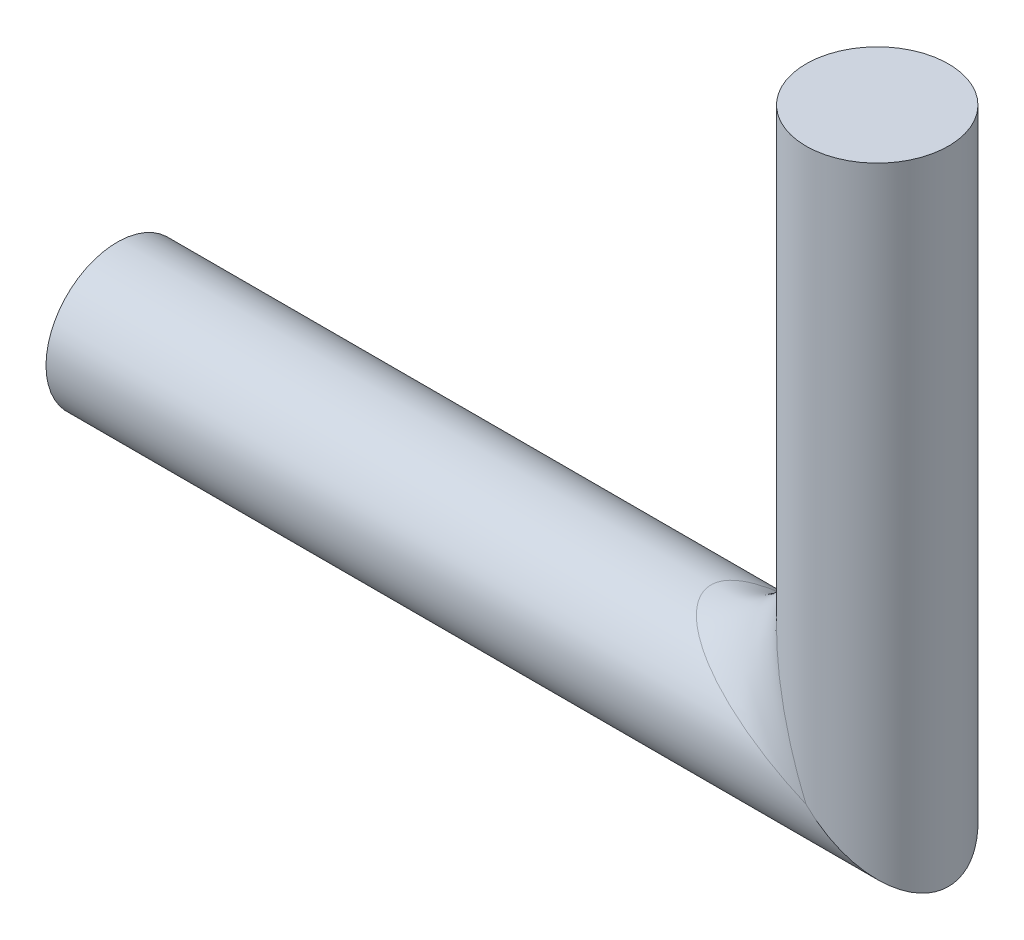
ISO-10303-21;
HEADER;
FILE_DESCRIPTION(('STEP AP214'),'2;1');
FILE_NAME('part.step','',(''),(''),'','','');
FILE_SCHEMA(('AUTOMOTIVE_DESIGN { 1 0 10303 214 1 1 1 1 }'));
ENDSEC;
DATA;
#1=APPLICATION_CONTEXT('core data for automotive mechanical design processes');
#2=APPLICATION_PROTOCOL_DEFINITION('international standard','automotive_design',2000,#1);
#3=PRODUCT_CONTEXT('',#1,'mechanical');
#4=PRODUCT('Part','Part','',(#3));
#5=PRODUCT_RELATED_PRODUCT_CATEGORY('part','',(#4));
#6=PRODUCT_DEFINITION_FORMATION('','',#4);
#7=PRODUCT_DEFINITION_CONTEXT('part definition',#1,'design');
#8=PRODUCT_DEFINITION('design','',#6,#7);
#9=PRODUCT_DEFINITION_SHAPE('','',#8);
#10=(LENGTH_UNIT() NAMED_UNIT(*) SI_UNIT(.MILLI.,.METRE.));
#11=(NAMED_UNIT(*) PLANE_ANGLE_UNIT() SI_UNIT($,.RADIAN.));
#12=(NAMED_UNIT(*) SI_UNIT($,.STERADIAN.) SOLID_ANGLE_UNIT());
#13=UNCERTAINTY_MEASURE_WITH_UNIT(LENGTH_MEASURE(1.E-05),#10,'distance_accuracy_value','');
#14=(GEOMETRIC_REPRESENTATION_CONTEXT(3) GLOBAL_UNCERTAINTY_ASSIGNED_CONTEXT((#13)) GLOBAL_UNIT_ASSIGNED_CONTEXT((#10,
#11,#12)) REPRESENTATION_CONTEXT('',''));
#15=CARTESIAN_POINT('',(0.,0.,0.));
#16=DIRECTION('',(0.,0.,1.));
#17=DIRECTION('',(1.,0.,0.));
#18=AXIS2_PLACEMENT_3D('',#15,#16,#17);
#19=CARTESIAN_POINT('',(18.,0.,0.));
#20=DIRECTION('',(-1.,0.,0.));
#21=DIRECTION('',(0.,0.,1.));
#22=AXIS2_PLACEMENT_3D('',#19,#20,#21);
#23=CYLINDRICAL_SURFACE('',#22,1.5);
#24=CARTESIAN_POINT('',(18.,0.,0.));
#25=DIRECTION('',(0.393919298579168,0.919145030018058,0.));
#26=DIRECTION('',(-0.919145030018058,0.393919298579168,0.));
#27=AXIS2_PLACEMENT_3D('',#24,#25,#26);
#28=ELLIPSE('',#27,3.80788655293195,1.5);
#29=CARTESIAN_POINT('',(18.,0.,1.5));
#30=VERTEX_POINT('',#29);
#31=CARTESIAN_POINT('',(18.,0.,-1.5));
#32=VERTEX_POINT('',#31);
#33=EDGE_CURVE('E52',#30,#32,#28,.F.);
#34=ORIENTED_EDGE('',*,*,#33,.T.);
#35=CARTESIAN_POINT('',(18.,0.,0.));
#36=DIRECTION('',(0.707106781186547,0.707106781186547,0.));
#37=DIRECTION('',(-0.707106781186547,0.707106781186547,0.));
#38=AXIS2_PLACEMENT_3D('',#35,#36,#37);
#39=ELLIPSE('',#38,2.12132034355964,1.5);
#40=EDGE_CURVE('E58',#30,#32,#39,.T.);
#41=ORIENTED_EDGE('',*,*,#40,.F.);
#42=EDGE_LOOP('',(#34,#41));
#43=FACE_BOUND('',#42,.T.);
#44=CARTESIAN_POINT('',(2.,0.,0.));
#45=DIRECTION('',(-1.,0.,0.));
#46=DIRECTION('',(0.,0.,1.));
#47=AXIS2_PLACEMENT_3D('',#44,#45,#46);
#48=CIRCLE('',#47,1.5);
#49=CARTESIAN_POINT('',(2.,0.,1.5));
#50=VERTEX_POINT('',#49);
#51=EDGE_CURVE('E47',#50,#50,#48,.T.);
#52=ORIENTED_EDGE('',*,*,#51,.F.);
#53=EDGE_LOOP('',(#52));
#54=FACE_BOUND('',#53,.T.);
#55=ADVANCED_FACE('F39',(#43,#54),#23,.T.);
#56=CARTESIAN_POINT('',(18.,-1.5,0.));
#57=DIRECTION('',(0.,1.,0.));
#58=DIRECTION('',(0.,0.,1.));
#59=AXIS2_PLACEMENT_3D('',#56,#57,#58);
#60=CYLINDRICAL_SURFACE('',#59,1.5);
#61=CARTESIAN_POINT('',(18.,12.,0.));
#62=DIRECTION('',(0.,1.,0.));
#63=DIRECTION('',(0.,0.,1.));
#64=AXIS2_PLACEMENT_3D('',#61,#62,#63);
#65=CIRCLE('',#64,1.5);
#66=CARTESIAN_POINT('',(18.,12.,1.5));
#67=VERTEX_POINT('',#66);
#68=EDGE_CURVE('E65',#67,#67,#65,.T.);
#69=ORIENTED_EDGE('',*,*,#68,.F.);
#70=EDGE_LOOP('',(#69));
#71=FACE_BOUND('',#70,.T.);
#72=CARTESIAN_POINT('',(18.,0.,0.));
#73=DIRECTION('',(0.919145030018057,0.393919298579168,0.));
#74=DIRECTION('',(-0.393919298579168,0.919145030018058,0.));
#75=AXIS2_PLACEMENT_3D('',#72,#73,#74);
#76=ELLIPSE('',#75,3.80788655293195,1.5);
#77=EDGE_CURVE('E11',#32,#30,#76,.T.);
#78=ORIENTED_EDGE('',*,*,#77,.T.);
#79=ORIENTED_EDGE('',*,*,#40,.T.);
#80=EDGE_LOOP('',(#78,#79));
#81=FACE_BOUND('',#80,.T.);
#82=ADVANCED_FACE('F67',(#71,#81),#60,.T.);
#83=CARTESIAN_POINT('',(18.,12.,0.));
#84=DIRECTION('',(0.,1.,0.));
#85=DIRECTION('',(0.,0.,1.));
#86=AXIS2_PLACEMENT_3D('',#83,#84,#85);
#87=PLANE('',#86);
#88=ORIENTED_EDGE('',*,*,#68,.T.);
#89=EDGE_LOOP('',(#88));
#90=FACE_BOUND('',#89,.T.);
#91=ADVANCED_FACE('F77',(#90),#87,.T.);
#92=CARTESIAN_POINT('',(18.,0.,1.5));
#93=CARTESIAN_POINT('',(18.,0.,1.5));
#94=CARTESIAN_POINT('',(18.,0.,1.5));
#95=CARTESIAN_POINT('',(17.8475233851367,0.0653471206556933,1.49997370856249));
#96=CARTESIAN_POINT('',(17.8910658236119,0.108934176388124,1.50023792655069));
#97=CARTESIAN_POINT('',(17.9346528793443,0.152476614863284,1.49997370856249));
#98=CARTESIAN_POINT('',(17.6950078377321,0.130710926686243,1.49572763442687));
#99=CARTESIAN_POINT('',(17.7818328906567,0.218167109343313,1.49002988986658));
#100=CARTESIAN_POINT('',(17.8692890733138,0.304992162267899,1.49572763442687));
#101=CARTESIAN_POINT('',(17.3925995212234,0.260314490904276,1.47867971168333));
#102=CARTESIAN_POINT('',(17.568083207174,0.431916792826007,1.45028833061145));
#103=CARTESIAN_POINT('',(17.7396855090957,0.607400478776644,1.47867971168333));
#104=CARTESIAN_POINT('',(17.2426954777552,0.324559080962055,1.46595089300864));
#105=CARTESIAN_POINT('',(17.4629485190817,0.537051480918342,1.42069733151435));
#106=CARTESIAN_POINT('',(17.6754409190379,0.757304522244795,1.46595089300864));
#107=CARTESIAN_POINT('',(16.9480630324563,0.450830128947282,1.43211276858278));
#108=CARTESIAN_POINT('',(17.261463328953,0.738536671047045,1.34340417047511));
#109=CARTESIAN_POINT('',(17.5491698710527,1.05193696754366,1.43211276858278));
#110=CARTESIAN_POINT('',(16.8032899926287,0.512875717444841,1.41114760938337));
#111=CARTESIAN_POINT('',(17.1645025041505,0.835497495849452,1.29558861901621));
#112=CARTESIAN_POINT('',(17.4871242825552,1.1967100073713,1.41114760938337));
#113=CARTESIAN_POINT('',(16.5214408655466,0.633668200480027,1.36111493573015));
#114=CARTESIAN_POINT('',(16.9833044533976,1.01669554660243,1.18453422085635));
#115=CARTESIAN_POINT('',(17.36633179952,1.4785591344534,1.36111493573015));
#116=CARTESIAN_POINT('',(16.3842630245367,0.692458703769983,1.33225974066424));
#117=CARTESIAN_POINT('',(16.8984764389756,1.10152356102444,1.12112509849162));
#118=CARTESIAN_POINT('',(17.30754129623,1.61573697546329,1.33225974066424));
#119=CARTESIAN_POINT('',(16.1200105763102,0.805709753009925,1.26687391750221));
#120=CARTESIAN_POINT('',(16.7452066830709,1.25479331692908,0.982824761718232));
#121=CARTESIAN_POINT('',(17.1942902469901,1.87998942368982,1.26687391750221));
#122=CARTESIAN_POINT('',(15.992753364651,0.860248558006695,1.23061683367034));
#123=CARTESIAN_POINT('',(16.676208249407,1.32379175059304,0.907711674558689));
#124=CARTESIAN_POINT('',(17.1397514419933,2.00724663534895,1.23061683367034));
#125=CARTESIAN_POINT('',(15.7506057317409,0.964026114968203,1.15098522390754));
#126=CARTESIAN_POINT('',(16.5576602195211,1.44233978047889,0.751598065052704));
#127=CARTESIAN_POINT('',(17.0359738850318,2.24939426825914,1.15098522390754));
#128=CARTESIAN_POINT('',(15.6354291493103,1.01338750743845,1.10793345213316));
#129=CARTESIAN_POINT('',(16.5076073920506,1.49239260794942,0.670336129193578));
#130=CARTESIAN_POINT('',(16.9866124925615,2.36457085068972,1.10793345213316));
#131=CARTESIAN_POINT('',(15.4195225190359,1.10591892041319,1.01540083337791));
#132=CARTESIAN_POINT('',(16.4288328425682,1.57116715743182,0.50933934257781));
#133=CARTESIAN_POINT('',(16.8940810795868,2.5804774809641,1.01540083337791));
#134=CARTESIAN_POINT('',(15.318386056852,1.14926311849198,0.96627201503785));
#135=CARTESIAN_POINT('',(16.3996810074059,1.60031899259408,0.429325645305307));
#136=CARTESIAN_POINT('',(16.850736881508,2.68161394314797,0.966272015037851));
#137=CARTESIAN_POINT('',(15.1324161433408,1.22896450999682,0.862400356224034));
#138=CARTESIAN_POINT('',(16.3624911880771,1.63750881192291,0.279863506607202));
#139=CARTESIAN_POINT('',(16.7710354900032,2.86758385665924,0.862400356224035));
#140=CARTESIAN_POINT('',(15.0470542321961,1.26554818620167,0.808009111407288));
#141=CARTESIAN_POINT('',(16.3541090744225,1.6458909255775,0.210147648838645));
#142=CARTESIAN_POINT('',(16.7344518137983,2.95294576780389,0.808009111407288));
#143=CARTESIAN_POINT('',(14.8942190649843,1.3310489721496,0.69455281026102));
#144=CARTESIAN_POINT('',(16.3549878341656,1.64501216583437,0.0907433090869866));
#145=CARTESIAN_POINT('',(16.6689510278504,3.10578093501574,0.69455281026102));
#146=CARTESIAN_POINT('',(14.8261222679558,1.36023331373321,0.635800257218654));
#147=CARTESIAN_POINT('',(16.3639888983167,1.63601110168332,0.0408222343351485));
#148=CARTESIAN_POINT('',(16.6397666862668,3.17387773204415,0.635800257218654));
#149=CARTESIAN_POINT('',(14.7090715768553,1.41039789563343,0.514682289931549));
#150=CARTESIAN_POINT('',(16.3921225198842,1.6078774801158,-0.0319538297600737));
#151=CARTESIAN_POINT('',(16.5896021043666,3.29092842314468,0.51468228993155));
#152=CARTESIAN_POINT('',(14.6594695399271,1.43165591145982,0.452550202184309));
#153=CARTESIAN_POINT('',(16.4110635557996,1.58893644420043,-0.0550080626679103));
#154=CARTESIAN_POINT('',(16.5683440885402,3.34053046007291,0.452550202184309));
#155=CARTESIAN_POINT('',(14.5802570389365,1.46560412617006,0.325838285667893));
#156=CARTESIAN_POINT('',(16.4484022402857,1.55159775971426,-0.0737245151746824));
#157=CARTESIAN_POINT('',(16.5343958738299,3.41974296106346,0.325838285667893));
#158=CARTESIAN_POINT('',(14.5500910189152,1.4785324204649,0.261387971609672));
#159=CARTESIAN_POINT('',(16.4666619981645,1.53333800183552,-0.0695857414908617));
#160=CARTESIAN_POINT('',(16.5214675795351,3.44990898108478,0.261387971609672));
#161=CARTESIAN_POINT('',(14.5101255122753,1.49566049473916,0.131266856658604));
#162=CARTESIAN_POINT('',(16.4924999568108,1.50750004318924,-0.0435187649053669));
#163=CARTESIAN_POINT('',(16.5043395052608,3.48987448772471,0.131266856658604));
#164=CARTESIAN_POINT('',(14.5,1.5,0.0656334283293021));
#165=CARTESIAN_POINT('',(16.5,1.5,-0.0218228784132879));
#166=CARTESIAN_POINT('',(16.5,3.5,0.0656334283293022));
#167=CARTESIAN_POINT('',(14.5,1.5,-0.065633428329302));
#168=CARTESIAN_POINT('',(16.5,1.5,0.0218228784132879));
#169=CARTESIAN_POINT('',(16.5,3.5,-0.0656334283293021));
#170=CARTESIAN_POINT('',(14.5101255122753,1.49566049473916,-0.131266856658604));
#171=CARTESIAN_POINT('',(16.4924999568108,1.50750004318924,0.0435187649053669));
#172=CARTESIAN_POINT('',(16.5043395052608,3.48987448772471,-0.131266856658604));
#173=CARTESIAN_POINT('',(14.5500910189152,1.4785324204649,-0.261387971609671));
#174=CARTESIAN_POINT('',(16.4666619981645,1.53333800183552,0.0695857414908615));
#175=CARTESIAN_POINT('',(16.5214675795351,3.44990898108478,-0.261387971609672));
#176=CARTESIAN_POINT('',(14.5802570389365,1.46560412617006,-0.325838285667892));
#177=CARTESIAN_POINT('',(16.4484022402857,1.55159775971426,0.0737245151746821));
#178=CARTESIAN_POINT('',(16.5343958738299,3.41974296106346,-0.325838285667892));
#179=CARTESIAN_POINT('',(14.6594695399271,1.43165591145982,-0.452550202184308));
#180=CARTESIAN_POINT('',(16.4110635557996,1.58893644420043,0.0550080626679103));
#181=CARTESIAN_POINT('',(16.5683440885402,3.34053046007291,-0.452550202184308));
#182=CARTESIAN_POINT('',(14.7090715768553,1.41039789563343,-0.514682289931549));
#183=CARTESIAN_POINT('',(16.3921225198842,1.6078774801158,0.0319538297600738));
#184=CARTESIAN_POINT('',(16.5896021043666,3.29092842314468,-0.514682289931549));
#185=CARTESIAN_POINT('',(14.8261222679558,1.36023331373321,-0.635800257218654));
#186=CARTESIAN_POINT('',(16.3639888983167,1.63601110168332,-0.0408222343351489));
#187=CARTESIAN_POINT('',(16.6397666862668,3.17387773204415,-0.635800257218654));
#188=CARTESIAN_POINT('',(14.8942190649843,1.3310489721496,-0.694552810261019));
#189=CARTESIAN_POINT('',(16.3549878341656,1.64501216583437,-0.0907433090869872));
#190=CARTESIAN_POINT('',(16.6689510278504,3.10578093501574,-0.69455281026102));
#191=CARTESIAN_POINT('',(15.0470542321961,1.26554818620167,-0.808009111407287));
#192=CARTESIAN_POINT('',(16.3541090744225,1.6458909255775,-0.210147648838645));
#193=CARTESIAN_POINT('',(16.7344518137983,2.95294576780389,-0.808009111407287));
#194=CARTESIAN_POINT('',(15.1324161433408,1.22896450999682,-0.862400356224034));
#195=CARTESIAN_POINT('',(16.3624911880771,1.63750881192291,-0.279863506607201));
#196=CARTESIAN_POINT('',(16.7710354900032,2.86758385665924,-0.862400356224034));
#197=CARTESIAN_POINT('',(15.318386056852,1.14926311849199,-0.966272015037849));
#198=CARTESIAN_POINT('',(16.3996810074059,1.60031899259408,-0.429325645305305));
#199=CARTESIAN_POINT('',(16.850736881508,2.68161394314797,-0.96627201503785));
#200=CARTESIAN_POINT('',(15.4195225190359,1.10591892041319,-1.0154008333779));
#201=CARTESIAN_POINT('',(16.4288328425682,1.57116715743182,-0.509339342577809));
#202=CARTESIAN_POINT('',(16.8940810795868,2.5804774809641,-1.01540083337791));
#203=CARTESIAN_POINT('',(15.6354291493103,1.01338750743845,-1.10793345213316));
#204=CARTESIAN_POINT('',(16.5076073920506,1.49239260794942,-0.670336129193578));
#205=CARTESIAN_POINT('',(16.9866124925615,2.36457085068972,-1.10793345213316));
#206=CARTESIAN_POINT('',(15.7506057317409,0.964026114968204,-1.15098522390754));
#207=CARTESIAN_POINT('',(16.5576602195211,1.44233978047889,-0.751598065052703));
#208=CARTESIAN_POINT('',(17.0359738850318,2.24939426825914,-1.15098522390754));
#209=CARTESIAN_POINT('',(15.992753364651,0.860248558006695,-1.23061683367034));
#210=CARTESIAN_POINT('',(16.676208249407,1.32379175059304,-0.907711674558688));
#211=CARTESIAN_POINT('',(17.1397514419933,2.00724663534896,-1.23061683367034));
#212=CARTESIAN_POINT('',(16.1200105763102,0.805709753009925,-1.26687391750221));
#213=CARTESIAN_POINT('',(16.7452066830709,1.25479331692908,-0.982824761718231));
#214=CARTESIAN_POINT('',(17.1942902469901,1.87998942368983,-1.26687391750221));
#215=CARTESIAN_POINT('',(16.3842630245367,0.692458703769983,-1.33225974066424));
#216=CARTESIAN_POINT('',(16.8984764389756,1.10152356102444,-1.12112509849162));
#217=CARTESIAN_POINT('',(17.30754129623,1.61573697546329,-1.33225974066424));
#218=CARTESIAN_POINT('',(16.5214408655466,0.633668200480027,-1.36111493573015));
#219=CARTESIAN_POINT('',(16.9833044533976,1.01669554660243,-1.18453422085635));
#220=CARTESIAN_POINT('',(17.36633179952,1.4785591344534,-1.36111493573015));
#221=CARTESIAN_POINT('',(16.8032899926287,0.512875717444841,-1.41114760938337));
#222=CARTESIAN_POINT('',(17.1645025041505,0.835497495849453,-1.29558861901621));
#223=CARTESIAN_POINT('',(17.4871242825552,1.1967100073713,-1.41114760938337));
#224=CARTESIAN_POINT('',(16.9480630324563,0.450830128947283,-1.43211276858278));
#225=CARTESIAN_POINT('',(17.261463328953,0.738536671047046,-1.34340417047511));
#226=CARTESIAN_POINT('',(17.5491698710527,1.05193696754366,-1.43211276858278));
#227=CARTESIAN_POINT('',(17.2426954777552,0.324559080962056,-1.46595089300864));
#228=CARTESIAN_POINT('',(17.4629485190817,0.537051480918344,-1.42069733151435));
#229=CARTESIAN_POINT('',(17.6754409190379,0.757304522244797,-1.46595089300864));
#230=CARTESIAN_POINT('',(17.3925995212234,0.260314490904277,-1.47867971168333));
#231=CARTESIAN_POINT('',(17.568083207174,0.431916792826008,-1.45028833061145));
#232=CARTESIAN_POINT('',(17.7396855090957,0.607400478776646,-1.47867971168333));
#233=CARTESIAN_POINT('',(17.6950078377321,0.130710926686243,-1.49572763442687));
#234=CARTESIAN_POINT('',(17.7818328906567,0.218167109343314,-1.49002988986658));
#235=CARTESIAN_POINT('',(17.8692890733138,0.3049921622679,-1.49572763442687));
#236=CARTESIAN_POINT('',(17.8475233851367,0.0653471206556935,-1.49997370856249));
#237=CARTESIAN_POINT('',(17.8910658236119,0.108934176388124,-1.50023792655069));
#238=CARTESIAN_POINT('',(17.9346528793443,0.152476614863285,-1.49997370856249));
#239=CARTESIAN_POINT('',(18.,0.,-1.5));
#240=CARTESIAN_POINT('',(18.,0.,-1.5));
#241=CARTESIAN_POINT('',(18.,0.,-1.5));
#242=(BOUNDED_SURFACE() B_SPLINE_SURFACE(3,2,((#92,#93,#94),(#95,#96,#97),(#98,#99,#100),(#101,
#102,#103),(#104,#105,#106),(#107,#108,#109),(#110,#111,#112),(#113,#114,#115),(#116,#117,#118),
(#119,#120,#121),(#122,#123,#124),(#125,#126,#127),(#128,#129,#130),(#131,#132,#133),(#134,#135,
#136),(#137,#138,#139),(#140,#141,#142),(#143,#144,#145),(#146,#147,#148),(#149,#150,#151),
(#152,#153,#154),(#155,#156,#157),(#158,#159,#160),(#161,#162,#163),(#164,#165,#166),(#167,#168,
#169),(#170,#171,#172),(#173,#174,#175),(#176,#177,#178),(#179,#180,#181),(#182,#183,#184),
(#185,#186,#187),(#188,#189,#190),(#191,#192,#193),(#194,#195,#196),(#197,#198,#199),(#200,#201,
#202),(#203,#204,#205),(#206,#207,#208),(#209,#210,#211),(#212,#213,#214),(#215,#216,#217),
(#218,#219,#220),(#221,#222,#223),(#224,#225,#226),(#227,#228,#229),(#230,#231,#232),(#233,#234,
#235),(#236,#237,#238),(#239,#240,#241)),.UNSPECIFIED.,.F.,.F.,
.F.) B_SPLINE_SURFACE_WITH_KNOTS((4,2,2,2,2,2,2,2,2,2,2,2,2,2,2,2,2,2,2,2,2,2,2,2,4),(3,3),(0.,
0.646765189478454,1.28803294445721,1.91854474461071,2.53352426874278,3.1289289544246,
3.70171211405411,4.25009349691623,4.77382620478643,5.27442871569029,5.75532117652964,
6.22177412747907,6.68057416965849,7.1393742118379,7.60582716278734,8.08671962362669,
8.58732213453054,9.11105484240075,9.65943622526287,10.2322193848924,10.8276240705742,
11.4426035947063,12.0731153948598,12.7143831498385,13.361148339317),(0.,1.),
.UNSPECIFIED.) GEOMETRIC_REPRESENTATION_ITEM() RATIONAL_B_SPLINE_SURFACE(((1.,1.,1.),(1.,
1.00000566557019,1.),(1.,0.998576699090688,1.),(1.,0.992910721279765,1.),(1.,0.988697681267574,
1.),(1.,0.97761712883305,1.),(1.,0.970795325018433,1.),(1.,0.954789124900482,1.),(1.,
0.945667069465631,1.),(1.,0.92548796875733,1.),(1.,0.914501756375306,1.),(1.,0.891169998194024,
1.),(1.,0.878891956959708,1.),(1.,0.853706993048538,1.),(1.,0.84084914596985,1.),(1.,
0.815387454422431,1.),(1.,0.802798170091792,1.),(1.,0.778880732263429,1.),(1.,0.767521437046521,
1.),(1.,0.747118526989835,1.),(1.,0.738001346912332,1.),(1.,0.723039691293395,1.),(1.,
0.717105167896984,1.),(1.,0.709170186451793,1.),(1.,0.707106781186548,1.),(1.,0.707106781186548,
1.),(1.,0.709170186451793,1.),(1.,0.717105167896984,1.),(1.,0.723039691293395,1.),(1.,
0.738001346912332,1.),(1.,0.747118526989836,1.),(1.,0.767521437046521,1.),(1.,0.778880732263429,
1.),(1.,0.802798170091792,1.),(1.,0.815387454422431,1.),(1.,0.84084914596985,1.),(1.,
0.853706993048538,1.),(1.,0.878891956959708,1.),(1.,0.891169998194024,1.),(1.,0.914501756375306,
1.),(1.,0.92548796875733,1.),(1.,0.945667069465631,1.),(1.,0.954789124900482,1.),(1.,
0.970795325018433,1.),(1.,0.97761712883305,1.),(1.,0.988697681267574,1.),(1.,0.992910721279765,
1.),(1.,0.998576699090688,1.),(1.,1.00000566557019,1.),(1.,1.,1.))) REPRESENTATION_ITEM('') SURFACE());
#243=ORIENTED_EDGE('',*,*,#33,.F.);
#244=ORIENTED_EDGE('',*,*,#77,.F.);
#245=EDGE_LOOP('',(#243,#244));
#246=FACE_BOUND('',#245,.T.);
#247=ADVANCED_FACE('F41',(#246),#242,.F.);
#248=CARTESIAN_POINT('',(2.,0.,0.));
#249=DIRECTION('',(-1.,0.,0.));
#250=DIRECTION('',(0.,0.,1.));
#251=AXIS2_PLACEMENT_3D('',#248,#249,#250);
#252=PLANE('',#251);
#253=ORIENTED_EDGE('',*,*,#51,.T.);
#254=EDGE_LOOP('',(#253));
#255=FACE_BOUND('',#254,.T.);
#256=ADVANCED_FACE('F88',(#255),#252,.T.);
#257=CLOSED_SHELL('',(#55,#82,#91,#247,#256));
#258=MANIFOLD_SOLID_BREP('B2',#257);
#259=ADVANCED_BREP_SHAPE_REPRESENTATION('',(#18,#258),#14);
#260=SHAPE_DEFINITION_REPRESENTATION(#9,#259);
ENDSEC;
END-ISO-10303-21;
